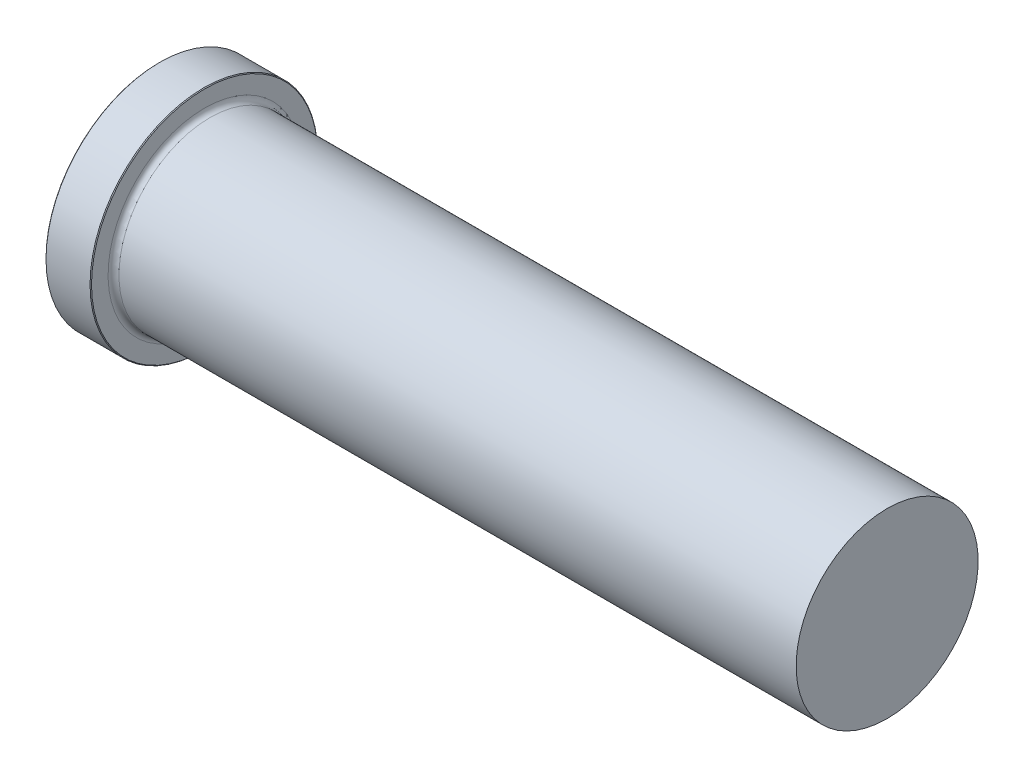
ISO-10303-21;
HEADER;
FILE_DESCRIPTION(('STEP AP214'),'2;1');
FILE_NAME('part.step','',(''),(''),'','','');
FILE_SCHEMA(('AUTOMOTIVE_DESIGN { 1 0 10303 214 1 1 1 1 }'));
ENDSEC;
DATA;
#1=APPLICATION_CONTEXT('core data for automotive mechanical design processes');
#2=APPLICATION_PROTOCOL_DEFINITION('international standard','automotive_design',2000,#1);
#3=PRODUCT_CONTEXT('',#1,'mechanical');
#4=PRODUCT('Part','Part','',(#3));
#5=PRODUCT_RELATED_PRODUCT_CATEGORY('part','',(#4));
#6=PRODUCT_DEFINITION_FORMATION('','',#4);
#7=PRODUCT_DEFINITION_CONTEXT('part definition',#1,'design');
#8=PRODUCT_DEFINITION('design','',#6,#7);
#9=PRODUCT_DEFINITION_SHAPE('','',#8);
#10=(LENGTH_UNIT() NAMED_UNIT(*) SI_UNIT(.MILLI.,.METRE.));
#11=(NAMED_UNIT(*) PLANE_ANGLE_UNIT() SI_UNIT($,.RADIAN.));
#12=(NAMED_UNIT(*) SI_UNIT($,.STERADIAN.) SOLID_ANGLE_UNIT());
#13=UNCERTAINTY_MEASURE_WITH_UNIT(LENGTH_MEASURE(1.E-05),#10,'distance_accuracy_value','');
#14=(GEOMETRIC_REPRESENTATION_CONTEXT(3) GLOBAL_UNCERTAINTY_ASSIGNED_CONTEXT((#13)) GLOBAL_UNIT_ASSIGNED_CONTEXT((#10,
#11,#12)) REPRESENTATION_CONTEXT('',''));
#15=CARTESIAN_POINT('',(0.,0.,0.));
#16=DIRECTION('',(0.,0.,1.));
#17=DIRECTION('',(1.,0.,0.));
#18=AXIS2_PLACEMENT_3D('',#15,#16,#17);
#19=CARTESIAN_POINT('',(101.6,12.7,0.));
#20=DIRECTION('',(1.,0.,0.));
#21=DIRECTION('',(0.,1.,0.));
#22=AXIS2_PLACEMENT_3D('',#19,#20,#21);
#23=PLANE('',#22);
#24=CARTESIAN_POINT('',(101.6,0.,0.));
#25=DIRECTION('',(1.,0.,0.));
#26=DIRECTION('',(0.,1.,0.));
#27=AXIS2_PLACEMENT_3D('',#24,#25,#26);
#28=CIRCLE('',#27,12.7);
#29=CARTESIAN_POINT('',(101.6,12.7,0.));
#30=VERTEX_POINT('',#29);
#31=EDGE_CURVE('E50',#30,#30,#28,.T.);
#32=ORIENTED_EDGE('',*,*,#31,.T.);
#33=EDGE_LOOP('',(#32));
#34=FACE_BOUND('',#33,.T.);
#35=ADVANCED_FACE('F30',(#34),#23,.T.);
#36=CARTESIAN_POINT('',(101.6,0.,0.));
#37=DIRECTION('',(1.,0.,0.));
#38=DIRECTION('',(0.,1.,0.));
#39=AXIS2_PLACEMENT_3D('',#36,#37,#38);
#40=CYLINDRICAL_SURFACE('',#39,12.7);
#41=CARTESIAN_POINT('',(7.11199999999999,0.,0.));
#42=DIRECTION('',(1.,0.,0.));
#43=DIRECTION('',(0.,1.,0.));
#44=AXIS2_PLACEMENT_3D('',#41,#42,#43);
#45=CIRCLE('',#44,12.7);
#46=CARTESIAN_POINT('',(7.11199999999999,12.7,0.));
#47=VERTEX_POINT('',#46);
#48=EDGE_CURVE('E53',#47,#47,#45,.T.);
#49=ORIENTED_EDGE('',*,*,#48,.T.);
#50=EDGE_LOOP('',(#49));
#51=FACE_BOUND('',#50,.T.);
#52=ORIENTED_EDGE('',*,*,#31,.F.);
#53=EDGE_LOOP('',(#52));
#54=FACE_BOUND('',#53,.T.);
#55=ADVANCED_FACE('F74',(#51,#54),#40,.T.);
#56=CARTESIAN_POINT('',(7.112,0.,0.));
#57=DIRECTION('',(1.,0.,0.));
#58=DIRECTION('',(0.,1.,0.));
#59=AXIS2_PLACEMENT_3D('',#56,#57,#58);
#60=TOROIDAL_SURFACE('',#59,13.462,0.762000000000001);
#61=CARTESIAN_POINT('',(6.34999999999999,0.,0.));
#62=DIRECTION('',(1.,0.,0.));
#63=DIRECTION('',(0.,1.,0.));
#64=AXIS2_PLACEMENT_3D('',#61,#62,#63);
#65=CIRCLE('',#64,13.462);
#66=CARTESIAN_POINT('',(6.35,13.462,0.));
#67=VERTEX_POINT('',#66);
#68=EDGE_CURVE('E56',#67,#67,#65,.T.);
#69=ORIENTED_EDGE('',*,*,#68,.T.);
#70=EDGE_LOOP('',(#69));
#71=FACE_BOUND('',#70,.T.);
#72=ORIENTED_EDGE('',*,*,#48,.F.);
#73=EDGE_LOOP('',(#72));
#74=FACE_BOUND('',#73,.T.);
#75=ADVANCED_FACE('F60',(#71,#74),#60,.F.);
#76=CARTESIAN_POINT('',(6.35,15.875,0.));
#77=DIRECTION('',(1.,0.,0.));
#78=DIRECTION('',(0.,1.,0.));
#79=AXIS2_PLACEMENT_3D('',#76,#77,#78);
#80=PLANE('',#79);
#81=CARTESIAN_POINT('',(6.35,0.,0.));
#82=DIRECTION('',(1.,0.,0.));
#83=DIRECTION('',(0.,1.,0.));
#84=AXIS2_PLACEMENT_3D('',#81,#82,#83);
#85=CIRCLE('',#84,15.7734);
#86=CARTESIAN_POINT('',(6.35,15.7734,0.));
#87=VERTEX_POINT('',#86);
#88=EDGE_CURVE('E10',#87,#87,#85,.T.);
#89=ORIENTED_EDGE('',*,*,#88,.T.);
#90=EDGE_LOOP('',(#89));
#91=FACE_BOUND('',#90,.T.);
#92=ORIENTED_EDGE('',*,*,#68,.F.);
#93=EDGE_LOOP('',(#92));
#94=FACE_BOUND('',#93,.T.);
#95=ADVANCED_FACE('F63',(#91,#94),#80,.T.);
#96=CARTESIAN_POINT('',(101.6,0.,0.));
#97=DIRECTION('',(1.,0.,0.));
#98=DIRECTION('',(0.,1.,0.));
#99=AXIS2_PLACEMENT_3D('',#96,#97,#98);
#100=CYLINDRICAL_SURFACE('',#99,15.875);
#101=CARTESIAN_POINT('',(0.101599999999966,0.,0.));
#102=DIRECTION('',(-1.,0.,0.));
#103=DIRECTION('',(0.,-1.,0.));
#104=AXIS2_PLACEMENT_3D('',#101,#102,#103);
#105=CIRCLE('',#104,15.875);
#106=CARTESIAN_POINT('',(0.101599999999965,-15.875,0.));
#107=VERTEX_POINT('',#106);
#108=EDGE_CURVE('E41',#107,#107,#105,.F.);
#109=ORIENTED_EDGE('',*,*,#108,.T.);
#110=EDGE_LOOP('',(#109));
#111=FACE_BOUND('',#110,.T.);
#112=CARTESIAN_POINT('',(6.24839999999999,0.,0.));
#113=DIRECTION('',(1.,0.,0.));
#114=DIRECTION('',(0.,1.,0.));
#115=AXIS2_PLACEMENT_3D('',#112,#113,#114);
#116=CIRCLE('',#115,15.875);
#117=CARTESIAN_POINT('',(6.24839999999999,15.875,0.));
#118=VERTEX_POINT('',#117);
#119=EDGE_CURVE('E45',#118,#118,#116,.F.);
#120=ORIENTED_EDGE('',*,*,#119,.T.);
#121=EDGE_LOOP('',(#120));
#122=FACE_BOUND('',#121,.T.);
#123=ADVANCED_FACE('F65',(#111,#122),#100,.T.);
#124=CARTESIAN_POINT('',(0.,0.,0.));
#125=DIRECTION('',(-1.,0.,0.));
#126=DIRECTION('',(0.,-1.,0.));
#127=AXIS2_PLACEMENT_3D('',#124,#125,#126);
#128=PLANE('',#127);
#129=CARTESIAN_POINT('',(0.,0.,0.));
#130=DIRECTION('',(-1.,0.,0.));
#131=DIRECTION('',(0.,-1.,0.));
#132=AXIS2_PLACEMENT_3D('',#129,#130,#131);
#133=CIRCLE('',#132,15.7734);
#134=CARTESIAN_POINT('',(0.,-15.7734,0.));
#135=VERTEX_POINT('',#134);
#136=EDGE_CURVE('E37',#135,#135,#133,.T.);
#137=ORIENTED_EDGE('',*,*,#136,.T.);
#138=EDGE_LOOP('',(#137));
#139=FACE_BOUND('',#138,.T.);
#140=ADVANCED_FACE('F71',(#139),#128,.T.);
#141=CARTESIAN_POINT('',(0.101599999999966,0.,0.));
#142=DIRECTION('',(1.,0.,0.));
#143=DIRECTION('',(0.,1.,0.));
#144=AXIS2_PLACEMENT_3D('',#141,#142,#143);
#145=CONICAL_SURFACE('',#144,15.875,0.785398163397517);
#146=ORIENTED_EDGE('',*,*,#136,.F.);
#147=EDGE_LOOP('',(#146));
#148=FACE_BOUND('',#147,.T.);
#149=ORIENTED_EDGE('',*,*,#108,.F.);
#150=EDGE_LOOP('',(#149));
#151=FACE_BOUND('',#150,.T.);
#152=ADVANCED_FACE('F84',(#148,#151),#145,.T.);
#153=CARTESIAN_POINT('',(6.34999999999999,0.,0.));
#154=DIRECTION('',(-1.,0.,0.));
#155=DIRECTION('',(0.,-1.,0.));
#156=AXIS2_PLACEMENT_3D('',#153,#154,#155);
#157=CONICAL_SURFACE('',#156,15.7734,0.785398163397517);
#158=ORIENTED_EDGE('',*,*,#119,.F.);
#159=EDGE_LOOP('',(#158));
#160=FACE_BOUND('',#159,.T.);
#161=ORIENTED_EDGE('',*,*,#88,.F.);
#162=EDGE_LOOP('',(#161));
#163=FACE_BOUND('',#162,.T.);
#164=ADVANCED_FACE('F32',(#160,#163),#157,.T.);
#165=CLOSED_SHELL('',(#35,#55,#75,#95,#123,#140,#152,#164));
#166=MANIFOLD_SOLID_BREP('B2',#165);
#167=ADVANCED_BREP_SHAPE_REPRESENTATION('',(#18,#166),#14);
#168=SHAPE_DEFINITION_REPRESENTATION(#9,#167);
ENDSEC;
END-ISO-10303-21;
